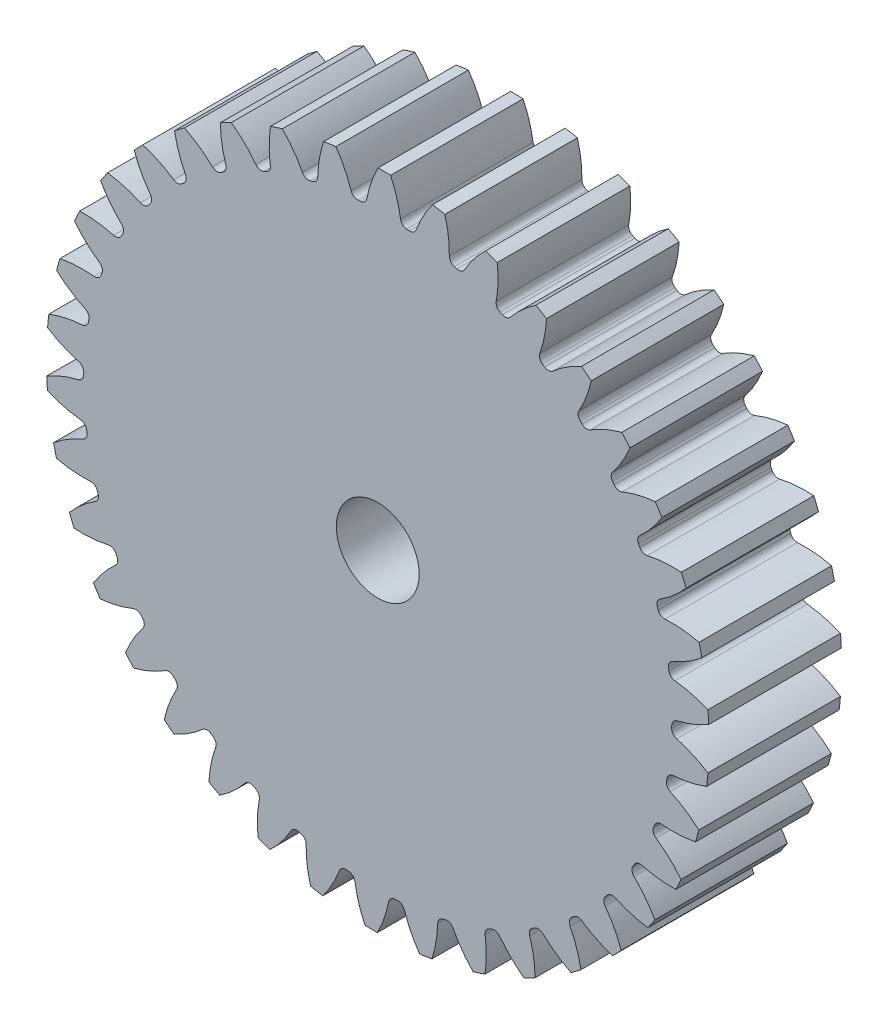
from build123d import *

# Parameters (mm, degrees)
SKETCH3_R         = 254
GEARBODY_DEPTH    = 101.6
TOOTHCUT_DEPTH    = 374.3022368
CIRPATTERN1_COUNT = 38
BOREDIA_R         = 31.75
BORE_DEPTH        = 12700


with BuildPart() as part:
    # Sketch3 → gearBody (new body)
    with BuildSketch(Plane.XY):
        Circle(SKETCH3_R)
    extrude(amount=GEARBODY_DEPTH)

    # Sketch2 → toothCut (cut, through all)
    with BuildSketch(Plane.XY):
        with BuildLine():
            ThreePointArc((225.358180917, -5.488252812), (225.380308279, -4.488570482), (225.398001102, -3.488799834))
            ThreePointArc((225.398001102, -3.488799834), (226.542301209, -0.32455463), (229.391811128, 1.464904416))
            ThreePointArc((229.391811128, 1.464904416), (242.071091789, 5.459016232), (254, 11.325721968))
            ThreePointArc((254, 11.325721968), (254.201971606, -5.062569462), (253.347655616, -21.429824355))
            ThreePointArc((253.347655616, -21.429824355), (241.661790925, -15.092817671), (229.15159092, -10.597043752))
            ThreePointArc((229.15159092, -10.597043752), (226.375588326, -8.695549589), (225.358180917, -5.488252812))
        make_face()
    toothcut = extrude(amount=TOOTHCUT_DEPTH, mode=Mode.SUBTRACT)

    # CirPattern1: toothCut ×38 about axis
    cirpattern1_axis = Axis((0, 0, 0), (0, 0, 1))
    for i in range(1, CIRPATTERN1_COUNT):
        add(toothcut.rotate(cirpattern1_axis, i * 360 / CIRPATTERN1_COUNT), mode=Mode.SUBTRACT)

    # boreDia → bore (cut, symmetric)
    with BuildSketch(Plane.XY):
        Circle(BOREDIA_R)
    extrude(amount=BORE_DEPTH, both=True, mode=Mode.SUBTRACT)


solid = part.part
